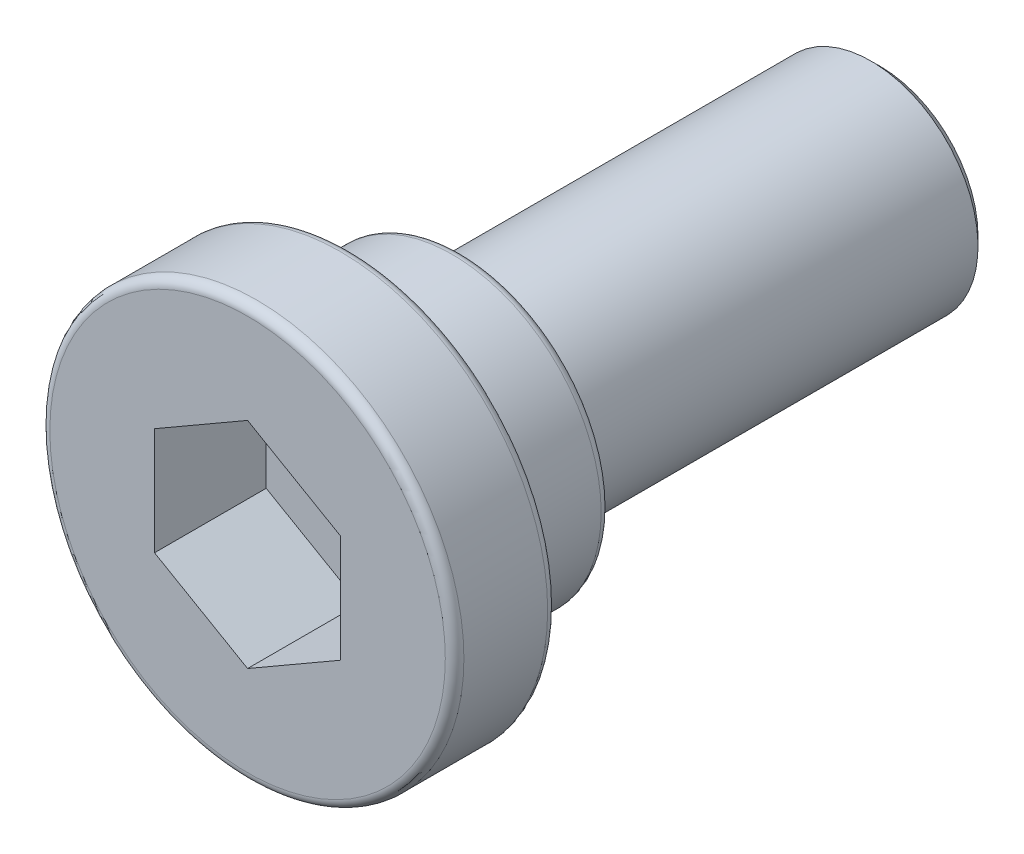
ISO-10303-21;
HEADER;
FILE_DESCRIPTION(('STEP AP214'),'2;1');
FILE_NAME('part.step','',(''),(''),'','','');
FILE_SCHEMA(('AUTOMOTIVE_DESIGN { 1 0 10303 214 1 1 1 1 }'));
ENDSEC;
DATA;
#1=APPLICATION_CONTEXT('core data for automotive mechanical design processes');
#2=APPLICATION_PROTOCOL_DEFINITION('international standard','automotive_design',2000,#1);
#3=PRODUCT_CONTEXT('',#1,'mechanical');
#4=PRODUCT('Part','Part','',(#3));
#5=PRODUCT_RELATED_PRODUCT_CATEGORY('part','',(#4));
#6=PRODUCT_DEFINITION_FORMATION('','',#4);
#7=PRODUCT_DEFINITION_CONTEXT('part definition',#1,'design');
#8=PRODUCT_DEFINITION('design','',#6,#7);
#9=PRODUCT_DEFINITION_SHAPE('','',#8);
#10=(LENGTH_UNIT() NAMED_UNIT(*) SI_UNIT(.MILLI.,.METRE.));
#11=(NAMED_UNIT(*) PLANE_ANGLE_UNIT() SI_UNIT($,.RADIAN.));
#12=(NAMED_UNIT(*) SI_UNIT($,.STERADIAN.) SOLID_ANGLE_UNIT());
#13=UNCERTAINTY_MEASURE_WITH_UNIT(LENGTH_MEASURE(1.E-05),#10,'distance_accuracy_value','');
#14=(GEOMETRIC_REPRESENTATION_CONTEXT(3) GLOBAL_UNCERTAINTY_ASSIGNED_CONTEXT((#13)) GLOBAL_UNIT_ASSIGNED_CONTEXT((#10,
#11,#12)) REPRESENTATION_CONTEXT('',''));
#15=CARTESIAN_POINT('',(0.,0.,0.));
#16=DIRECTION('',(0.,0.,1.));
#17=DIRECTION('',(1.,0.,0.));
#18=AXIS2_PLACEMENT_3D('',#15,#16,#17);
#19=CARTESIAN_POINT('',(0.,0.,5.6));
#20=DIRECTION('',(0.,0.,1.));
#21=DIRECTION('',(1.,0.,0.));
#22=AXIS2_PLACEMENT_3D('',#19,#20,#21);
#23=PLANE('',#22);
#24=DIRECTION('',(0.866025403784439,0.5,0.));
#25=VECTOR('',#24,1.);
#26=CARTESIAN_POINT('',(0.,-1.15470053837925,5.6));
#27=LINE('',#26,#25);
#28=CARTESIAN_POINT('',(0.,-1.15470053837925,5.6));
#29=VERTEX_POINT('',#28);
#30=CARTESIAN_POINT('',(1.,-0.577350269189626,5.6));
#31=VERTEX_POINT('',#30);
#32=EDGE_CURVE('E87',#29,#31,#27,.T.);
#33=ORIENTED_EDGE('',*,*,#32,.T.);
#34=DIRECTION('',(0.,1.,0.));
#35=VECTOR('',#34,1.);
#36=CARTESIAN_POINT('',(1.,-0.577350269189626,5.6));
#37=LINE('',#36,#35);
#38=CARTESIAN_POINT('',(1.,0.577350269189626,5.6));
#39=VERTEX_POINT('',#38);
#40=EDGE_CURVE('E89',#31,#39,#37,.T.);
#41=ORIENTED_EDGE('',*,*,#40,.T.);
#42=DIRECTION('',(-0.866025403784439,0.5,0.));
#43=VECTOR('',#42,1.);
#44=CARTESIAN_POINT('',(1.,0.577350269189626,5.6));
#45=LINE('',#44,#43);
#46=CARTESIAN_POINT('',(0.,1.15470053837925,5.6));
#47=VERTEX_POINT('',#46);
#48=EDGE_CURVE('E91',#39,#47,#45,.T.);
#49=ORIENTED_EDGE('',*,*,#48,.T.);
#50=DIRECTION('',(-0.866025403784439,-0.5,0.));
#51=VECTOR('',#50,1.);
#52=CARTESIAN_POINT('',(0.,1.15470053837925,5.6));
#53=LINE('',#52,#51);
#54=CARTESIAN_POINT('',(-1.,0.577350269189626,5.6));
#55=VERTEX_POINT('',#54);
#56=EDGE_CURVE('E241',#47,#55,#53,.T.);
#57=ORIENTED_EDGE('',*,*,#56,.T.);
#58=DIRECTION('',(0.,-1.,0.));
#59=VECTOR('',#58,1.);
#60=CARTESIAN_POINT('',(-1.,0.577350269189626,5.6));
#61=LINE('',#60,#59);
#62=CARTESIAN_POINT('',(-1.,-0.577350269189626,5.6));
#63=VERTEX_POINT('',#62);
#64=EDGE_CURVE('E246',#55,#63,#61,.T.);
#65=ORIENTED_EDGE('',*,*,#64,.T.);
#66=DIRECTION('',(0.866025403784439,-0.5,0.));
#67=VECTOR('',#66,1.);
#68=CARTESIAN_POINT('',(-1.,-0.577350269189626,5.6));
#69=LINE('',#68,#67);
#70=EDGE_CURVE('E250',#63,#29,#69,.T.);
#71=ORIENTED_EDGE('',*,*,#70,.T.);
#72=EDGE_LOOP('',(#33,#41,#49,#57,#65,#71));
#73=FACE_BOUND('',#72,.T.);
#74=ADVANCED_FACE('F17',(#73),#23,.T.);
#75=CARTESIAN_POINT('',(1.,0.577350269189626,5.6));
#76=DIRECTION('',(0.5,0.866025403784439,0.));
#77=DIRECTION('',(-0.866025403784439,0.5,0.));
#78=AXIS2_PLACEMENT_3D('',#75,#76,#77);
#79=PLANE('',#78);
#80=DIRECTION('',(0.,0.,1.));
#81=VECTOR('',#80,1.);
#82=CARTESIAN_POINT('',(0.,1.15470053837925,5.6));
#83=LINE('',#82,#81);
#84=CARTESIAN_POINT('',(0.,1.15470053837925,6.8));
#85=VERTEX_POINT('',#84);
#86=EDGE_CURVE('E102',#85,#47,#83,.F.);
#87=ORIENTED_EDGE('',*,*,#86,.T.);
#88=ORIENTED_EDGE('',*,*,#48,.F.);
#89=DIRECTION('',(0.,0.,1.));
#90=VECTOR('',#89,1.);
#91=CARTESIAN_POINT('',(1.,0.577350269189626,5.6));
#92=LINE('',#91,#90);
#93=CARTESIAN_POINT('',(1.,0.577350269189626,6.8));
#94=VERTEX_POINT('',#93);
#95=EDGE_CURVE('E96',#39,#94,#92,.T.);
#96=ORIENTED_EDGE('',*,*,#95,.T.);
#97=DIRECTION('',(0.866025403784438,-0.5,0.));
#98=VECTOR('',#97,1.);
#99=CARTESIAN_POINT('',(0.,1.15470053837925,6.8));
#100=LINE('',#99,#98);
#101=EDGE_CURVE('E240',#85,#94,#100,.T.);
#102=ORIENTED_EDGE('',*,*,#101,.F.);
#103=EDGE_LOOP('',(#87,#88,#96,#102));
#104=FACE_BOUND('',#103,.T.);
#105=ADVANCED_FACE('F99',(#104),#79,.F.);
#106=CARTESIAN_POINT('',(1.,-0.577350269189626,5.6));
#107=DIRECTION('',(1.,0.,0.));
#108=DIRECTION('',(0.,1.,0.));
#109=AXIS2_PLACEMENT_3D('',#106,#107,#108);
#110=PLANE('',#109);
#111=ORIENTED_EDGE('',*,*,#95,.F.);
#112=ORIENTED_EDGE('',*,*,#40,.F.);
#113=DIRECTION('',(0.,0.,1.));
#114=VECTOR('',#113,1.);
#115=CARTESIAN_POINT('',(1.,-0.577350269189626,5.6));
#116=LINE('',#115,#114);
#117=CARTESIAN_POINT('',(1.,-0.577350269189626,6.8));
#118=VERTEX_POINT('',#117);
#119=EDGE_CURVE('E110',#31,#118,#116,.T.);
#120=ORIENTED_EDGE('',*,*,#119,.T.);
#121=DIRECTION('',(0.,1.,0.));
#122=VECTOR('',#121,1.);
#123=CARTESIAN_POINT('',(1.,0.,6.8));
#124=LINE('',#123,#122);
#125=EDGE_CURVE('E107',#94,#118,#124,.F.);
#126=ORIENTED_EDGE('',*,*,#125,.F.);
#127=EDGE_LOOP('',(#111,#112,#120,#126));
#128=FACE_BOUND('',#127,.T.);
#129=ADVANCED_FACE('F105',(#128),#110,.F.);
#130=CARTESIAN_POINT('',(0.,-1.15470053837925,5.6));
#131=DIRECTION('',(0.5,-0.866025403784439,0.));
#132=DIRECTION('',(0.866025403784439,0.5,0.));
#133=AXIS2_PLACEMENT_3D('',#130,#131,#132);
#134=PLANE('',#133);
#135=ORIENTED_EDGE('',*,*,#119,.F.);
#136=ORIENTED_EDGE('',*,*,#32,.F.);
#137=DIRECTION('',(0.,0.,1.));
#138=VECTOR('',#137,1.);
#139=CARTESIAN_POINT('',(0.,-1.15470053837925,5.6));
#140=LINE('',#139,#138);
#141=CARTESIAN_POINT('',(0.,-1.15470053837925,6.8));
#142=VERTEX_POINT('',#141);
#143=EDGE_CURVE('E248',#29,#142,#140,.T.);
#144=ORIENTED_EDGE('',*,*,#143,.T.);
#145=DIRECTION('',(-0.866025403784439,-0.5,0.));
#146=VECTOR('',#145,1.);
#147=CARTESIAN_POINT('',(1.,-0.577350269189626,6.8));
#148=LINE('',#147,#146);
#149=EDGE_CURVE('E254',#118,#142,#148,.T.);
#150=ORIENTED_EDGE('',*,*,#149,.F.);
#151=EDGE_LOOP('',(#135,#136,#144,#150));
#152=FACE_BOUND('',#151,.T.);
#153=ADVANCED_FACE('F255',(#152),#134,.F.);
#154=CARTESIAN_POINT('',(-1.,-0.577350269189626,5.6));
#155=DIRECTION('',(-0.5,-0.866025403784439,0.));
#156=DIRECTION('',(0.866025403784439,-0.5,0.));
#157=AXIS2_PLACEMENT_3D('',#154,#155,#156);
#158=PLANE('',#157);
#159=ORIENTED_EDGE('',*,*,#143,.F.);
#160=ORIENTED_EDGE('',*,*,#70,.F.);
#161=DIRECTION('',(0.,0.,1.));
#162=VECTOR('',#161,1.);
#163=CARTESIAN_POINT('',(-1.,-0.577350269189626,5.6));
#164=LINE('',#163,#162);
#165=CARTESIAN_POINT('',(-1.,-0.577350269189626,6.8));
#166=VERTEX_POINT('',#165);
#167=EDGE_CURVE('E244',#63,#166,#164,.T.);
#168=ORIENTED_EDGE('',*,*,#167,.T.);
#169=DIRECTION('',(-0.866025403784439,0.5,0.));
#170=VECTOR('',#169,1.);
#171=CARTESIAN_POINT('',(0.,-1.15470053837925,6.8));
#172=LINE('',#171,#170);
#173=EDGE_CURVE('E260',#142,#166,#172,.T.);
#174=ORIENTED_EDGE('',*,*,#173,.F.);
#175=EDGE_LOOP('',(#159,#160,#168,#174));
#176=FACE_BOUND('',#175,.T.);
#177=ADVANCED_FACE('F393',(#176),#158,.F.);
#178=CARTESIAN_POINT('',(-1.,0.577350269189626,5.6));
#179=DIRECTION('',(-1.,0.,0.));
#180=DIRECTION('',(0.,-1.,0.));
#181=AXIS2_PLACEMENT_3D('',#178,#179,#180);
#182=PLANE('',#181);
#183=ORIENTED_EDGE('',*,*,#167,.F.);
#184=ORIENTED_EDGE('',*,*,#64,.F.);
#185=DIRECTION('',(0.,0.,1.));
#186=VECTOR('',#185,1.);
#187=CARTESIAN_POINT('',(-1.,0.577350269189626,5.6));
#188=LINE('',#187,#186);
#189=CARTESIAN_POINT('',(-1.,0.577350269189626,6.8));
#190=VERTEX_POINT('',#189);
#191=EDGE_CURVE('E233',#55,#190,#188,.T.);
#192=ORIENTED_EDGE('',*,*,#191,.T.);
#193=DIRECTION('',(0.,1.,0.));
#194=VECTOR('',#193,1.);
#195=CARTESIAN_POINT('',(-1.,0.,6.8));
#196=LINE('',#195,#194);
#197=EDGE_CURVE('E268',#166,#190,#196,.T.);
#198=ORIENTED_EDGE('',*,*,#197,.F.);
#199=EDGE_LOOP('',(#183,#184,#192,#198));
#200=FACE_BOUND('',#199,.T.);
#201=ADVANCED_FACE('F303',(#200),#182,.F.);
#202=CARTESIAN_POINT('',(0.,1.15470053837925,5.6));
#203=DIRECTION('',(-0.5,0.866025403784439,0.));
#204=DIRECTION('',(-0.866025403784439,-0.5,0.));
#205=AXIS2_PLACEMENT_3D('',#202,#203,#204);
#206=PLANE('',#205);
#207=ORIENTED_EDGE('',*,*,#191,.F.);
#208=ORIENTED_EDGE('',*,*,#56,.F.);
#209=ORIENTED_EDGE('',*,*,#86,.F.);
#210=DIRECTION('',(0.866025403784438,0.5,0.));
#211=VECTOR('',#210,1.);
#212=CARTESIAN_POINT('',(-1.,0.577350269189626,6.8));
#213=LINE('',#212,#211);
#214=EDGE_CURVE('E270',#190,#85,#213,.T.);
#215=ORIENTED_EDGE('',*,*,#214,.F.);
#216=EDGE_LOOP('',(#207,#208,#209,#215));
#217=FACE_BOUND('',#216,.T.);
#218=ADVANCED_FACE('F298',(#217),#206,.F.);
#219=CARTESIAN_POINT('',(0.,0.,6.8));
#220=DIRECTION('',(0.,0.,1.));
#221=DIRECTION('',(1.,0.,0.));
#222=AXIS2_PLACEMENT_3D('',#219,#220,#221);
#223=PLANE('',#222);
#224=ORIENTED_EDGE('',*,*,#197,.T.);
#225=ORIENTED_EDGE('',*,*,#214,.T.);
#226=ORIENTED_EDGE('',*,*,#101,.T.);
#227=ORIENTED_EDGE('',*,*,#125,.T.);
#228=ORIENTED_EDGE('',*,*,#149,.T.);
#229=ORIENTED_EDGE('',*,*,#173,.T.);
#230=EDGE_LOOP('',(#224,#225,#226,#227,#228,#229));
#231=FACE_BOUND('',#230,.T.);
#232=CARTESIAN_POINT('',(0.,0.,6.8));
#233=DIRECTION('',(0.,0.,-1.));
#234=DIRECTION('',(-1.,0.,0.));
#235=AXIS2_PLACEMENT_3D('',#232,#233,#234);
#236=CIRCLE('',#235,2.125);
#237=CARTESIAN_POINT('',(-2.125,0.,6.8));
#238=VERTEX_POINT('',#237);
#239=CARTESIAN_POINT('',(2.125,0.,6.8));
#240=VERTEX_POINT('',#239);
#241=EDGE_CURVE('E272',#238,#240,#236,.T.);
#242=ORIENTED_EDGE('',*,*,#241,.F.);
#243=CARTESIAN_POINT('',(0.,0.,6.8));
#244=DIRECTION('',(0.,0.,-1.));
#245=DIRECTION('',(1.,0.,0.));
#246=AXIS2_PLACEMENT_3D('',#243,#244,#245);
#247=CIRCLE('',#246,2.125);
#248=EDGE_CURVE('E212',#240,#238,#247,.T.);
#249=ORIENTED_EDGE('',*,*,#248,.F.);
#250=EDGE_LOOP('',(#242,#249));
#251=FACE_BOUND('',#250,.T.);
#252=ADVANCED_FACE('F221',(#231,#251),#223,.T.);
#253=CARTESIAN_POINT('',(0.,0.,6.7));
#254=DIRECTION('',(0.,0.,1.));
#255=DIRECTION('',(1.,0.,0.));
#256=AXIS2_PLACEMENT_3D('',#253,#254,#255);
#257=TOROIDAL_SURFACE('',#256,2.125,0.1);
#258=CARTESIAN_POINT('',(0.,0.,6.7));
#259=DIRECTION('',(0.,0.,-1.));
#260=DIRECTION('',(-1.,0.,0.));
#261=AXIS2_PLACEMENT_3D('',#258,#259,#260);
#262=CIRCLE('',#261,2.225);
#263=CARTESIAN_POINT('',(-2.225,0.,6.7));
#264=VERTEX_POINT('',#263);
#265=EDGE_CURVE('E209',#264,#264,#262,.T.);
#266=ORIENTED_EDGE('',*,*,#265,.F.);
#267=EDGE_LOOP('',(#266));
#268=FACE_BOUND('',#267,.T.);
#269=ORIENTED_EDGE('',*,*,#248,.T.);
#270=ORIENTED_EDGE('',*,*,#241,.T.);
#271=EDGE_LOOP('',(#269,#270));
#272=FACE_BOUND('',#271,.T.);
#273=ADVANCED_FACE('F216',(#268,#272),#257,.T.);
#274=CARTESIAN_POINT('',(0.,0.,6.8));
#275=DIRECTION('',(0.,0.,-1.));
#276=DIRECTION('',(-1.,0.,0.));
#277=AXIS2_PLACEMENT_3D('',#274,#275,#276);
#278=CYLINDRICAL_SURFACE('',#277,2.225);
#279=ORIENTED_EDGE('',*,*,#265,.T.);
#280=EDGE_LOOP('',(#279));
#281=FACE_BOUND('',#280,.T.);
#282=CARTESIAN_POINT('',(0.,0.,5.8));
#283=DIRECTION('',(0.,0.,1.));
#284=DIRECTION('',(1.,0.,0.));
#285=AXIS2_PLACEMENT_3D('',#282,#283,#284);
#286=CIRCLE('',#285,2.225);
#287=CARTESIAN_POINT('',(2.225,0.,5.8));
#288=VERTEX_POINT('',#287);
#289=EDGE_CURVE('E201',#288,#288,#286,.F.);
#290=ORIENTED_EDGE('',*,*,#289,.F.);
#291=EDGE_LOOP('',(#290));
#292=FACE_BOUND('',#291,.T.);
#293=ADVANCED_FACE('F220',(#281,#292),#278,.T.);
#294=CARTESIAN_POINT('',(0.,0.,5.8));
#295=DIRECTION('',(0.,0.,1.));
#296=DIRECTION('',(1.,0.,0.));
#297=AXIS2_PLACEMENT_3D('',#294,#295,#296);
#298=TOROIDAL_SURFACE('',#297,2.125,0.1);
#299=CARTESIAN_POINT('',(0.,0.,5.7));
#300=DIRECTION('',(0.,0.,1.));
#301=DIRECTION('',(1.,0.,0.));
#302=AXIS2_PLACEMENT_3D('',#299,#300,#301);
#303=CIRCLE('',#302,2.125);
#304=CARTESIAN_POINT('',(2.125,0.,5.7));
#305=VERTEX_POINT('',#304);
#306=CARTESIAN_POINT('',(-2.125,0.,5.7));
#307=VERTEX_POINT('',#306);
#308=EDGE_CURVE('E167',#305,#307,#303,.T.);
#309=ORIENTED_EDGE('',*,*,#308,.T.);
#310=CARTESIAN_POINT('',(0.,0.,5.7));
#311=DIRECTION('',(0.,0.,1.));
#312=DIRECTION('',(-1.,0.,0.));
#313=AXIS2_PLACEMENT_3D('',#310,#311,#312);
#314=CIRCLE('',#313,2.125);
#315=EDGE_CURVE('E123',#307,#305,#314,.T.);
#316=ORIENTED_EDGE('',*,*,#315,.T.);
#317=EDGE_LOOP('',(#309,#316));
#318=FACE_BOUND('',#317,.T.);
#319=ORIENTED_EDGE('',*,*,#289,.T.);
#320=EDGE_LOOP('',(#319));
#321=FACE_BOUND('',#320,.T.);
#322=ADVANCED_FACE('F181',(#318,#321),#298,.T.);
#323=CARTESIAN_POINT('',(0.,0.,5.7));
#324=DIRECTION('',(0.,0.,1.));
#325=DIRECTION('',(1.,0.,0.));
#326=AXIS2_PLACEMENT_3D('',#323,#324,#325);
#327=PLANE('',#326);
#328=CARTESIAN_POINT('',(0.,0.,5.7));
#329=DIRECTION('',(0.,0.,-1.));
#330=DIRECTION('',(-1.,0.,0.));
#331=AXIS2_PLACEMENT_3D('',#328,#329,#330);
#332=CIRCLE('',#331,1.6);
#333=CARTESIAN_POINT('',(-1.6,0.,5.7));
#334=VERTEX_POINT('',#333);
#335=EDGE_CURVE('E120',#334,#334,#332,.T.);
#336=ORIENTED_EDGE('',*,*,#335,.F.);
#337=EDGE_LOOP('',(#336));
#338=FACE_BOUND('',#337,.T.);
#339=ORIENTED_EDGE('',*,*,#308,.F.);
#340=ORIENTED_EDGE('',*,*,#315,.F.);
#341=EDGE_LOOP('',(#339,#340));
#342=FACE_BOUND('',#341,.T.);
#343=ADVANCED_FACE('F172',(#338,#342),#327,.F.);
#344=CARTESIAN_POINT('',(0.,0.,5.7));
#345=DIRECTION('',(0.,0.,-1.));
#346=DIRECTION('',(-1.,0.,0.));
#347=AXIS2_PLACEMENT_3D('',#344,#345,#346);
#348=CYLINDRICAL_SURFACE('',#347,1.6);
#349=ORIENTED_EDGE('',*,*,#335,.T.);
#350=EDGE_LOOP('',(#349));
#351=FACE_BOUND('',#350,.T.);
#352=CARTESIAN_POINT('',(0.,0.,4.6));
#353=DIRECTION('',(0.,0.,1.));
#354=DIRECTION('',(1.,0.,0.));
#355=AXIS2_PLACEMENT_3D('',#352,#353,#354);
#356=CIRCLE('',#355,1.6);
#357=CARTESIAN_POINT('',(1.6,0.,4.6));
#358=VERTEX_POINT('',#357);
#359=EDGE_CURVE('E122',#358,#358,#356,.F.);
#360=ORIENTED_EDGE('',*,*,#359,.F.);
#361=EDGE_LOOP('',(#360));
#362=FACE_BOUND('',#361,.T.);
#363=ADVANCED_FACE('F142',(#351,#362),#348,.T.);
#364=CARTESIAN_POINT('',(0.,0.,4.6));
#365=DIRECTION('',(0.,0.,1.));
#366=DIRECTION('',(1.,0.,0.));
#367=AXIS2_PLACEMENT_3D('',#364,#365,#366);
#368=TOROIDAL_SURFACE('',#367,1.5,0.1);
#369=CARTESIAN_POINT('',(0.,0.,4.5));
#370=DIRECTION('',(0.,0.,1.));
#371=DIRECTION('',(1.,0.,0.));
#372=AXIS2_PLACEMENT_3D('',#369,#370,#371);
#373=CIRCLE('',#372,1.5);
#374=CARTESIAN_POINT('',(1.5,0.,4.5));
#375=VERTEX_POINT('',#374);
#376=CARTESIAN_POINT('',(-1.5,0.,4.5));
#377=VERTEX_POINT('',#376);
#378=EDGE_CURVE('E36',#375,#377,#373,.T.);
#379=ORIENTED_EDGE('',*,*,#378,.T.);
#380=CARTESIAN_POINT('',(0.,0.,4.5));
#381=DIRECTION('',(0.,0.,1.));
#382=DIRECTION('',(-1.,0.,0.));
#383=AXIS2_PLACEMENT_3D('',#380,#381,#382);
#384=CIRCLE('',#383,1.5);
#385=EDGE_CURVE('E119',#377,#375,#384,.T.);
#386=ORIENTED_EDGE('',*,*,#385,.T.);
#387=EDGE_LOOP('',(#379,#386));
#388=FACE_BOUND('',#387,.T.);
#389=ORIENTED_EDGE('',*,*,#359,.T.);
#390=EDGE_LOOP('',(#389));
#391=FACE_BOUND('',#390,.T.);
#392=ADVANCED_FACE('F130',(#388,#391),#368,.T.);
#393=CARTESIAN_POINT('',(0.,0.,0.));
#394=DIRECTION('',(0.,0.,1.));
#395=DIRECTION('',(1.,0.,0.));
#396=AXIS2_PLACEMENT_3D('',#393,#394,#395);
#397=PLANE('',#396);
#398=CARTESIAN_POINT('',(0.,0.,-5.6843418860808E-11));
#399=DIRECTION('',(0.,0.,1.));
#400=DIRECTION('',(0.,-1.,0.));
#401=AXIS2_PLACEMENT_3D('',#398,#399,#400);
#402=CIRCLE('',#401,1.0499999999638);
#403=CARTESIAN_POINT('',(0.,-1.0499999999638,-5.68434126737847E-11));
#404=VERTEX_POINT('',#403);
#405=EDGE_CURVE('E116',#404,#404,#402,.T.);
#406=ORIENTED_EDGE('',*,*,#405,.F.);
#407=EDGE_LOOP('',(#406));
#408=FACE_BOUND('',#407,.T.);
#409=ADVANCED_FACE('F141',(#408),#397,.F.);
#410=CARTESIAN_POINT('',(0.,0.,4.5));
#411=DIRECTION('',(0.,0.,1.));
#412=DIRECTION('',(1.,0.,0.));
#413=AXIS2_PLACEMENT_3D('',#410,#411,#412);
#414=PLANE('',#413);
#415=CARTESIAN_POINT('',(0.,0.,4.5));
#416=DIRECTION('',(0.,0.,-1.));
#417=DIRECTION('',(-1.,0.,0.));
#418=AXIS2_PLACEMENT_3D('',#415,#416,#417);
#419=CIRCLE('',#418,1.15);
#420=CARTESIAN_POINT('',(-1.15,0.,4.5));
#421=VERTEX_POINT('',#420);
#422=EDGE_CURVE('E28',#421,#421,#419,.T.);
#423=ORIENTED_EDGE('',*,*,#422,.F.);
#424=EDGE_LOOP('',(#423));
#425=FACE_BOUND('',#424,.T.);
#426=ORIENTED_EDGE('',*,*,#378,.F.);
#427=ORIENTED_EDGE('',*,*,#385,.F.);
#428=EDGE_LOOP('',(#426,#427));
#429=FACE_BOUND('',#428,.T.);
#430=ADVANCED_FACE('F313',(#425,#429),#414,.F.);
#431=CARTESIAN_POINT('',(0.,0.,0.0999999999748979));
#432=DIRECTION('',(0.,0.,1.));
#433=DIRECTION('',(0.,-1.,0.));
#434=AXIS2_PLACEMENT_3D('',#431,#432,#433);
#435=CONICAL_SURFACE('',#434,1.14999999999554,0.785398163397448);
#436=CARTESIAN_POINT('',(0.,0.,0.1));
#437=DIRECTION('',(0.,0.,-1.));
#438=DIRECTION('',(-1.,0.,0.));
#439=AXIS2_PLACEMENT_3D('',#436,#437,#438);
#440=CIRCLE('',#439,1.15);
#441=CARTESIAN_POINT('',(-1.15,0.,0.1));
#442=VERTEX_POINT('',#441);
#443=EDGE_CURVE('E11',#442,#442,#440,.F.);
#444=ORIENTED_EDGE('',*,*,#443,.F.);
#445=EDGE_LOOP('',(#444));
#446=FACE_BOUND('',#445,.T.);
#447=ORIENTED_EDGE('',*,*,#405,.T.);
#448=EDGE_LOOP('',(#447));
#449=FACE_BOUND('',#448,.T.);
#450=ADVANCED_FACE('F307',(#446,#449),#435,.T.);
#451=CARTESIAN_POINT('',(0.,0.,4.5));
#452=DIRECTION('',(0.,0.,-1.));
#453=DIRECTION('',(-1.,0.,0.));
#454=AXIS2_PLACEMENT_3D('',#451,#452,#453);
#455=CYLINDRICAL_SURFACE('',#454,1.15);
#456=ORIENTED_EDGE('',*,*,#443,.T.);
#457=EDGE_LOOP('',(#456));
#458=FACE_BOUND('',#457,.T.);
#459=ORIENTED_EDGE('',*,*,#422,.T.);
#460=EDGE_LOOP('',(#459));
#461=FACE_BOUND('',#460,.T.);
#462=ADVANCED_FACE('F305',(#458,#461),#455,.T.);
#463=CLOSED_SHELL('',(#74,#105,#129,#153,#177,#201,#218,#252,#273,#293,#322,#343,#363,#392,#409,
#430,#450,#462));
#464=MANIFOLD_SOLID_BREP('B1',#463);
#465=ADVANCED_BREP_SHAPE_REPRESENTATION('',(#18,#464),#14);
#466=SHAPE_DEFINITION_REPRESENTATION(#9,#465);
ENDSEC;
END-ISO-10303-21;
